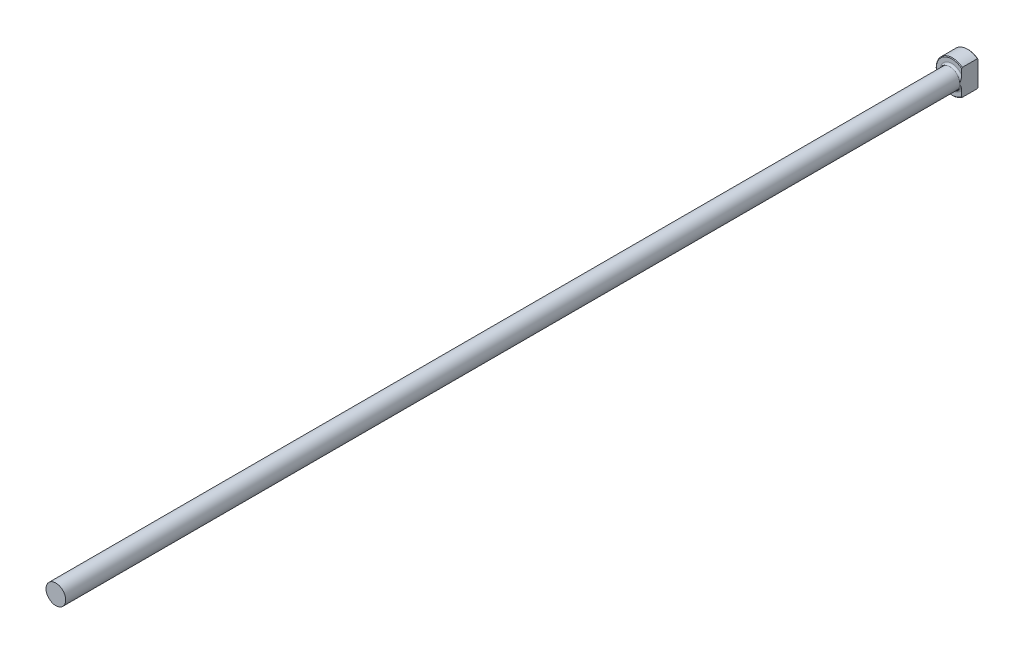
from build123d import *

# Parameters (mm, degrees)
CHAMFER1_SIZE      = 0.254
CUT_EXTRUDE1_REACH = 357.713


with BuildPart() as part:
    # Sketch1 → Revolve1 (revolve)
    with BuildSketch(Plane(origin=(0, 0, 0), x_dir=(0, 0, -1), z_dir=(1, 0, 0)), mode=Mode.PRIVATE) as revolve1_sk:
        with BuildLine():
            Line((0, 0), (0, 6.35))
            Line((0, 6.35), (-6.35, 6.35))
            Line((-6.35, 6.35), (-6.35, 4.59486))
            ThreePointArc((-6.35, 4.59486), (-6.573184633, 4.056044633), (-7.112, 3.83286))
            Line((-7.112, 3.83286), (-355.6, 3.83286))
            Line((-355.6, 3.83286), (-355.6, 0))
            Line((-355.6, 0), (0, 0))
        make_face()
    revolve(revolve1_sk.sketch.rotate(Axis((0, 0, -25.434744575), (0, 0, 1)), 90), axis=Axis((0, 0, -25.434744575), (0, 0, 1)))

    # Chamfer1
    chamfer1_edges = [part.edges().sort_by_distance(p)[0] for p in [
        (6.35, 0, 0),
        (6.35, 0, 6.35),
    ]]
    chamfer(chamfer1_edges, length=CHAMFER1_SIZE)

    # Sketch2 → Cut-Extrude1 (cut, up to next)
    with BuildSketch(Plane(origin=(0, 0, 0), x_dir=(-1, 0, 0), z_dir=(0, 0, -1)), mode=Mode.PRIVATE) as cut_extrude1_sk1:
        with BuildLine():
            Line((-3.83286, 5.06277436), (-3.83286, -5.06277436))
            ThreePointArc((-3.83286, -5.06277436), (-6.35, 0), (-3.83286, 5.06277436))
        make_face()
    cut_extrude1_tool1 = extrude(cut_extrude1_sk1.sketch, amount=-CUT_EXTRUDE1_REACH, mode=Mode.PRIVATE) & part.part
    add(cut_extrude1_tool1.solids().sort_by_distance((4.859058, 0, 0))[0], mode=Mode.SUBTRACT)


solid = part.part
